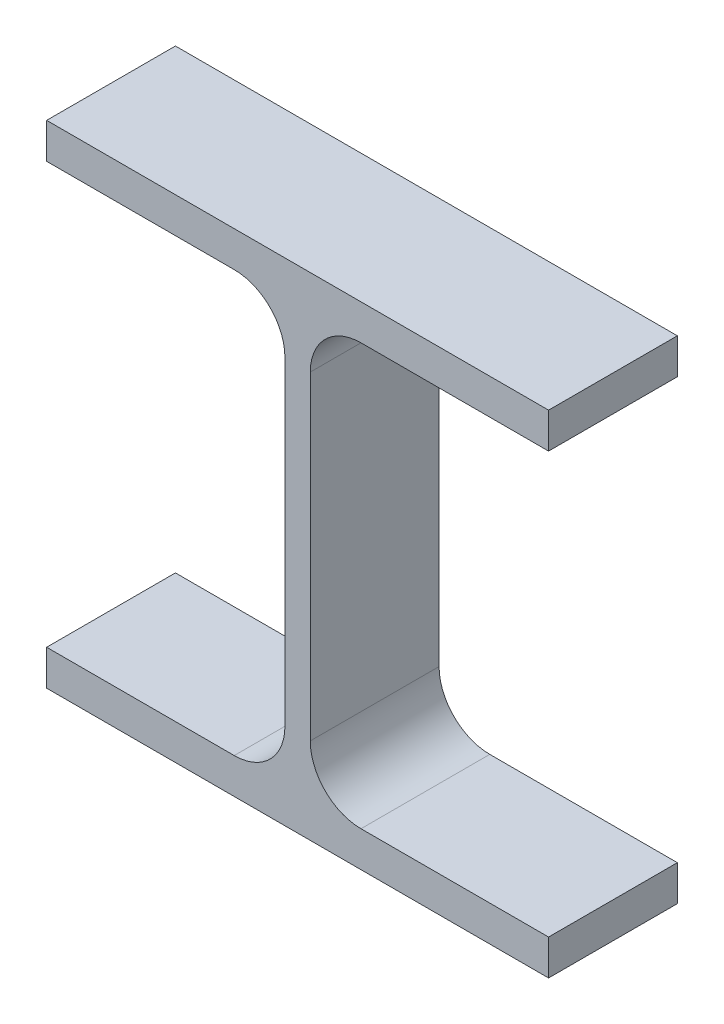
from build123d import *

# Parameters (mm, degrees)
BASESECTION_DEPTH = 12.7


with BuildPart() as part:
    # Sketch1 → BaseSection (new, symmetric)
    with BuildSketch(Plane.XY):
        with BuildLine():
            Line((-49.5, 48.5), (49.5, 48.5))
            Line((49.5, 48.5), (49.5, 41.5))
            Line((49.5, 41.5), (12.5, 41.5))
            ThreePointArc((12.5, 41.5), (5.428932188, 38.571067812), (2.5, 31.5))
            Line((2.5, 31.5), (2.5, -31.5))
            ThreePointArc((2.5, -31.5), (5.428932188, -38.571067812), (12.5, -41.5))
            Line((12.5, -41.5), (49.5, -41.5))
            Line((49.5, -41.5), (49.5, -48.5))
            Line((49.5, -48.5), (-49.5, -48.5))
            Line((-49.5, -48.5), (-49.5, -41.5))
            Line((-49.5, -41.5), (-12.5, -41.5))
            ThreePointArc((-12.5, -41.5), (-5.428932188, -38.571067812), (-2.5, -31.5))
            Line((-2.5, -31.5), (-2.5, 31.5))
            ThreePointArc((-2.5, 31.5), (-5.428932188, 38.571067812), (-12.5, 41.5))
            Line((-12.5, 41.5), (-49.5, 41.5))
            Line((-49.5, 41.5), (-49.5, 48.5))
        make_face()
    extrude(amount=BASESECTION_DEPTH, both=True)


solid = part.part
